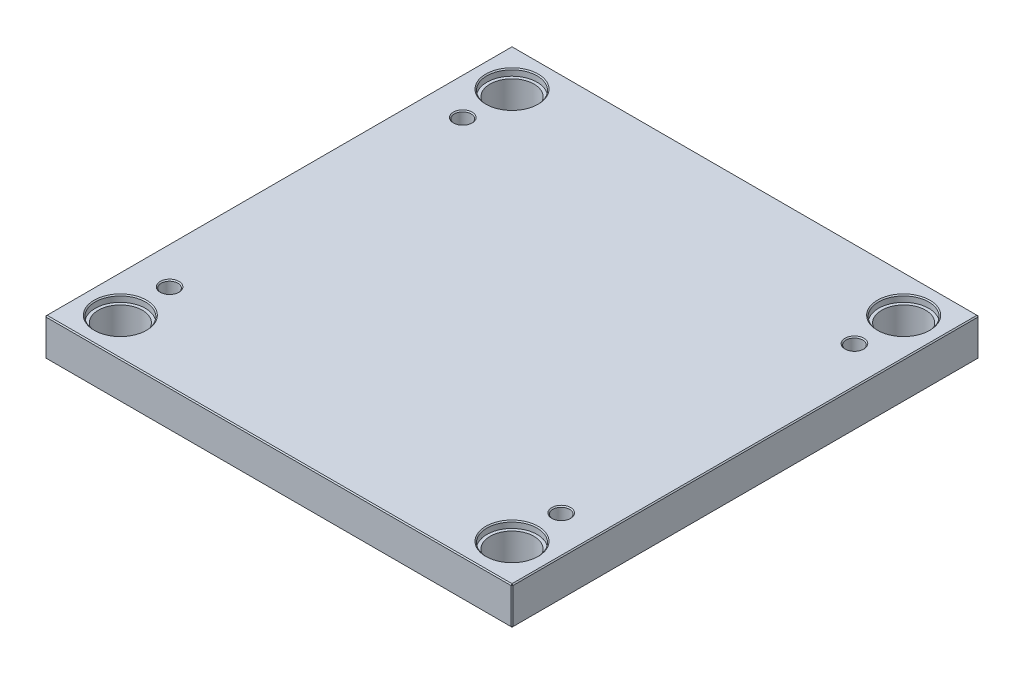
ISO-10303-21;
HEADER;
FILE_DESCRIPTION(('STEP AP214'),'2;1');
FILE_NAME('part.step','',(''),(''),'','','');
FILE_SCHEMA(('AUTOMOTIVE_DESIGN { 1 0 10303 214 1 1 1 1 }'));
ENDSEC;
DATA;
#1=APPLICATION_CONTEXT('core data for automotive mechanical design processes');
#2=APPLICATION_PROTOCOL_DEFINITION('international standard','automotive_design',2000,#1);
#3=PRODUCT_CONTEXT('',#1,'mechanical');
#4=PRODUCT('Part','Part','',(#3));
#5=PRODUCT_RELATED_PRODUCT_CATEGORY('part','',(#4));
#6=PRODUCT_DEFINITION_FORMATION('','',#4);
#7=PRODUCT_DEFINITION_CONTEXT('part definition',#1,'design');
#8=PRODUCT_DEFINITION('design','',#6,#7);
#9=PRODUCT_DEFINITION_SHAPE('','',#8);
#10=(LENGTH_UNIT() NAMED_UNIT(*) SI_UNIT(.MILLI.,.METRE.));
#11=(NAMED_UNIT(*) PLANE_ANGLE_UNIT() SI_UNIT($,.RADIAN.));
#12=(NAMED_UNIT(*) SI_UNIT($,.STERADIAN.) SOLID_ANGLE_UNIT());
#13=UNCERTAINTY_MEASURE_WITH_UNIT(LENGTH_MEASURE(1.E-05),#10,'distance_accuracy_value','');
#14=(GEOMETRIC_REPRESENTATION_CONTEXT(3) GLOBAL_UNCERTAINTY_ASSIGNED_CONTEXT((#13)) GLOBAL_UNIT_ASSIGNED_CONTEXT((#10,
#11,#12)) REPRESENTATION_CONTEXT('',''));
#15=CARTESIAN_POINT('',(0.,0.,0.));
#16=DIRECTION('',(0.,0.,1.));
#17=DIRECTION('',(1.,0.,0.));
#18=AXIS2_PLACEMENT_3D('',#15,#16,#17);
#19=CARTESIAN_POINT('',(-187.,0.,-187.));
#20=DIRECTION('',(0.,1.,0.));
#21=DIRECTION('',(0.,0.,1.));
#22=AXIS2_PLACEMENT_3D('',#19,#20,#21);
#23=CYLINDRICAL_SURFACE('',#22,21.);
#24=CARTESIAN_POINT('',(-187.,1.00000000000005,-187.));
#25=DIRECTION('',(0.,1.,0.));
#26=DIRECTION('',(0.,0.,1.));
#27=AXIS2_PLACEMENT_3D('',#24,#25,#26);
#28=CIRCLE('',#27,21.);
#29=CARTESIAN_POINT('',(-187.,1.00000000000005,-166.));
#30=VERTEX_POINT('',#29);
#31=EDGE_CURVE('E472',#30,#30,#28,.F.);
#32=ORIENTED_EDGE('',*,*,#31,.T.);
#33=EDGE_LOOP('',(#32));
#34=FACE_BOUND('',#33,.T.);
#35=CARTESIAN_POINT('',(-187.,29.7,-187.));
#36=DIRECTION('',(0.,1.,0.));
#37=DIRECTION('',(0.,0.,1.));
#38=AXIS2_PLACEMENT_3D('',#35,#36,#37);
#39=CIRCLE('',#38,21.);
#40=CARTESIAN_POINT('',(-187.,29.7,-166.));
#41=VERTEX_POINT('',#40);
#42=EDGE_CURVE('E221',#41,#41,#39,.F.);
#43=ORIENTED_EDGE('',*,*,#42,.F.);
#44=EDGE_LOOP('',(#43));
#45=FACE_BOUND('',#44,.T.);
#46=ADVANCED_FACE('F16',(#34,#45),#23,.F.);
#47=CARTESIAN_POINT('',(187.,0.,-187.));
#48=DIRECTION('',(0.,1.,0.));
#49=DIRECTION('',(0.,0.,1.));
#50=AXIS2_PLACEMENT_3D('',#47,#48,#49);
#51=CYLINDRICAL_SURFACE('',#50,21.);
#52=CARTESIAN_POINT('',(187.,1.00000000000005,-187.));
#53=DIRECTION('',(0.,1.,0.));
#54=DIRECTION('',(0.,0.,1.));
#55=AXIS2_PLACEMENT_3D('',#52,#53,#54);
#56=CIRCLE('',#55,21.);
#57=CARTESIAN_POINT('',(187.,1.00000000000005,-166.));
#58=VERTEX_POINT('',#57);
#59=EDGE_CURVE('E474',#58,#58,#56,.F.);
#60=ORIENTED_EDGE('',*,*,#59,.T.);
#61=EDGE_LOOP('',(#60));
#62=FACE_BOUND('',#61,.T.);
#63=CARTESIAN_POINT('',(187.,29.7,-187.));
#64=DIRECTION('',(0.,1.,0.));
#65=DIRECTION('',(0.,0.,1.));
#66=AXIS2_PLACEMENT_3D('',#63,#64,#65);
#67=CIRCLE('',#66,21.);
#68=CARTESIAN_POINT('',(187.,29.7,-166.));
#69=VERTEX_POINT('',#68);
#70=EDGE_CURVE('E218',#69,#69,#67,.F.);
#71=ORIENTED_EDGE('',*,*,#70,.F.);
#72=EDGE_LOOP('',(#71));
#73=FACE_BOUND('',#72,.T.);
#74=ADVANCED_FACE('F263',(#62,#73),#51,.F.);
#75=CARTESIAN_POINT('',(187.,0.,187.));
#76=DIRECTION('',(0.,1.,0.));
#77=DIRECTION('',(0.,0.,1.));
#78=AXIS2_PLACEMENT_3D('',#75,#76,#77);
#79=CYLINDRICAL_SURFACE('',#78,21.);
#80=CARTESIAN_POINT('',(187.,0.999999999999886,187.));
#81=DIRECTION('',(0.,1.,0.));
#82=DIRECTION('',(0.,0.,1.));
#83=AXIS2_PLACEMENT_3D('',#80,#81,#82);
#84=CIRCLE('',#83,21.);
#85=CARTESIAN_POINT('',(187.,0.999999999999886,208.));
#86=VERTEX_POINT('',#85);
#87=EDGE_CURVE('E477',#86,#86,#84,.F.);
#88=ORIENTED_EDGE('',*,*,#87,.T.);
#89=EDGE_LOOP('',(#88));
#90=FACE_BOUND('',#89,.T.);
#91=CARTESIAN_POINT('',(187.,29.7,187.));
#92=DIRECTION('',(0.,1.,0.));
#93=DIRECTION('',(0.,0.,1.));
#94=AXIS2_PLACEMENT_3D('',#91,#92,#93);
#95=CIRCLE('',#94,21.);
#96=CARTESIAN_POINT('',(187.,29.7,208.));
#97=VERTEX_POINT('',#96);
#98=EDGE_CURVE('E214',#97,#97,#95,.F.);
#99=ORIENTED_EDGE('',*,*,#98,.F.);
#100=EDGE_LOOP('',(#99));
#101=FACE_BOUND('',#100,.T.);
#102=ADVANCED_FACE('F270',(#90,#101),#79,.F.);
#103=CARTESIAN_POINT('',(-187.,0.,187.));
#104=DIRECTION('',(0.,1.,0.));
#105=DIRECTION('',(0.,0.,1.));
#106=AXIS2_PLACEMENT_3D('',#103,#104,#105);
#107=CYLINDRICAL_SURFACE('',#106,21.);
#108=CARTESIAN_POINT('',(-187.,0.999999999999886,187.));
#109=DIRECTION('',(0.,1.,0.));
#110=DIRECTION('',(0.,0.,1.));
#111=AXIS2_PLACEMENT_3D('',#108,#109,#110);
#112=CIRCLE('',#111,21.);
#113=CARTESIAN_POINT('',(-187.,0.999999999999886,208.));
#114=VERTEX_POINT('',#113);
#115=EDGE_CURVE('E480',#114,#114,#112,.F.);
#116=ORIENTED_EDGE('',*,*,#115,.T.);
#117=EDGE_LOOP('',(#116));
#118=FACE_BOUND('',#117,.T.);
#119=CARTESIAN_POINT('',(-187.,29.7,187.));
#120=DIRECTION('',(0.,1.,0.));
#121=DIRECTION('',(0.,0.,1.));
#122=AXIS2_PLACEMENT_3D('',#119,#120,#121);
#123=CIRCLE('',#122,21.);
#124=CARTESIAN_POINT('',(-187.,29.7,208.));
#125=VERTEX_POINT('',#124);
#126=EDGE_CURVE('E211',#125,#125,#123,.F.);
#127=ORIENTED_EDGE('',*,*,#126,.F.);
#128=EDGE_LOOP('',(#127));
#129=FACE_BOUND('',#128,.T.);
#130=ADVANCED_FACE('F277',(#118,#129),#107,.F.);
#131=CARTESIAN_POINT('',(-223.,36.,223.));
#132=DIRECTION('',(1.,0.,0.));
#133=DIRECTION('',(0.,0.,-1.));
#134=AXIS2_PLACEMENT_3D('',#131,#132,#133);
#135=PLANE('',#134);
#136=DIRECTION('',(0.,-1.,0.));
#137=VECTOR('',#136,1.);
#138=CARTESIAN_POINT('',(-223.,36.,-222.));
#139=LINE('',#138,#137);
#140=CARTESIAN_POINT('',(-223.,35.,-222.));
#141=VERTEX_POINT('',#140);
#142=CARTESIAN_POINT('',(-223.,1.,-222.));
#143=VERTEX_POINT('',#142);
#144=EDGE_CURVE('E487',#141,#143,#139,.T.);
#145=ORIENTED_EDGE('',*,*,#144,.T.);
#146=DIRECTION('',(0.,0.,1.));
#147=VECTOR('',#146,1.);
#148=CARTESIAN_POINT('',(-223.,1.,223.));
#149=LINE('',#148,#147);
#150=CARTESIAN_POINT('',(-223.,1.,222.));
#151=VERTEX_POINT('',#150);
#152=EDGE_CURVE('E490',#143,#151,#149,.T.);
#153=ORIENTED_EDGE('',*,*,#152,.T.);
#154=DIRECTION('',(0.,1.,0.));
#155=VECTOR('',#154,1.);
#156=CARTESIAN_POINT('',(-223.,36.,222.));
#157=LINE('',#156,#155);
#158=CARTESIAN_POINT('',(-223.,35.,222.));
#159=VERTEX_POINT('',#158);
#160=EDGE_CURVE('E485',#151,#159,#157,.T.);
#161=ORIENTED_EDGE('',*,*,#160,.T.);
#162=DIRECTION('',(0.,0.,-1.));
#163=VECTOR('',#162,1.);
#164=CARTESIAN_POINT('',(-223.,35.,-223.));
#165=LINE('',#164,#163);
#166=EDGE_CURVE('E483',#159,#141,#165,.T.);
#167=ORIENTED_EDGE('',*,*,#166,.T.);
#168=EDGE_LOOP('',(#145,#153,#161,#167));
#169=FACE_BOUND('',#168,.T.);
#170=ADVANCED_FACE('F298',(#169),#135,.F.);
#171=CARTESIAN_POINT('',(223.,36.,223.));
#172=DIRECTION('',(0.,0.,-1.));
#173=DIRECTION('',(-1.,0.,0.));
#174=AXIS2_PLACEMENT_3D('',#171,#172,#173);
#175=PLANE('',#174);
#176=DIRECTION('',(-1.,0.,0.));
#177=VECTOR('',#176,1.);
#178=CARTESIAN_POINT('',(-223.,35.,223.));
#179=LINE('',#178,#177);
#180=CARTESIAN_POINT('',(222.,35.,223.));
#181=VERTEX_POINT('',#180);
#182=CARTESIAN_POINT('',(-222.,35.,223.));
#183=VERTEX_POINT('',#182);
#184=EDGE_CURVE('E509',#181,#183,#179,.T.);
#185=ORIENTED_EDGE('',*,*,#184,.T.);
#186=DIRECTION('',(0.,-1.,0.));
#187=VECTOR('',#186,1.);
#188=CARTESIAN_POINT('',(-222.,36.,223.));
#189=LINE('',#188,#187);
#190=CARTESIAN_POINT('',(-222.,1.,223.));
#191=VERTEX_POINT('',#190);
#192=EDGE_CURVE('E515',#183,#191,#189,.T.);
#193=ORIENTED_EDGE('',*,*,#192,.T.);
#194=DIRECTION('',(1.,0.,0.));
#195=VECTOR('',#194,1.);
#196=CARTESIAN_POINT('',(223.,1.,223.));
#197=LINE('',#196,#195);
#198=CARTESIAN_POINT('',(222.,1.,223.));
#199=VERTEX_POINT('',#198);
#200=EDGE_CURVE('E513',#191,#199,#197,.T.);
#201=ORIENTED_EDGE('',*,*,#200,.T.);
#202=DIRECTION('',(0.,1.,0.));
#203=VECTOR('',#202,1.);
#204=CARTESIAN_POINT('',(222.,36.,223.));
#205=LINE('',#204,#203);
#206=EDGE_CURVE('E511',#199,#181,#205,.T.);
#207=ORIENTED_EDGE('',*,*,#206,.T.);
#208=EDGE_LOOP('',(#185,#193,#201,#207));
#209=FACE_BOUND('',#208,.T.);
#210=ADVANCED_FACE('F294',(#209),#175,.F.);
#211=CARTESIAN_POINT('',(223.,36.,223.));
#212=DIRECTION('',(-1.,0.,0.));
#213=DIRECTION('',(0.,0.,1.));
#214=AXIS2_PLACEMENT_3D('',#211,#212,#213);
#215=PLANE('',#214);
#216=DIRECTION('',(0.,0.,-1.));
#217=VECTOR('',#216,1.);
#218=CARTESIAN_POINT('',(223.,1.,223.));
#219=LINE('',#218,#217);
#220=CARTESIAN_POINT('',(223.,1.,222.));
#221=VERTEX_POINT('',#220);
#222=CARTESIAN_POINT('',(223.,1.,-222.));
#223=VERTEX_POINT('',#222);
#224=EDGE_CURVE('E504',#221,#223,#219,.T.);
#225=ORIENTED_EDGE('',*,*,#224,.T.);
#226=DIRECTION('',(0.,1.,0.));
#227=VECTOR('',#226,1.);
#228=CARTESIAN_POINT('',(223.,36.,-222.));
#229=LINE('',#228,#227);
#230=CARTESIAN_POINT('',(223.,35.,-222.));
#231=VERTEX_POINT('',#230);
#232=EDGE_CURVE('E506',#223,#231,#229,.T.);
#233=ORIENTED_EDGE('',*,*,#232,.T.);
#234=DIRECTION('',(0.,0.,1.));
#235=VECTOR('',#234,1.);
#236=CARTESIAN_POINT('',(223.,35.,223.));
#237=LINE('',#236,#235);
#238=CARTESIAN_POINT('',(223.,35.,222.));
#239=VERTEX_POINT('',#238);
#240=EDGE_CURVE('E500',#231,#239,#237,.T.);
#241=ORIENTED_EDGE('',*,*,#240,.T.);
#242=DIRECTION('',(0.,-1.,0.));
#243=VECTOR('',#242,1.);
#244=CARTESIAN_POINT('',(223.,36.,222.));
#245=LINE('',#244,#243);
#246=EDGE_CURVE('E502',#239,#221,#245,.T.);
#247=ORIENTED_EDGE('',*,*,#246,.T.);
#248=EDGE_LOOP('',(#225,#233,#241,#247));
#249=FACE_BOUND('',#248,.T.);
#250=ADVANCED_FACE('F290',(#249),#215,.F.);
#251=CARTESIAN_POINT('',(223.,36.,-223.));
#252=DIRECTION('',(0.,0.,1.));
#253=DIRECTION('',(1.,0.,0.));
#254=AXIS2_PLACEMENT_3D('',#251,#252,#253);
#255=PLANE('',#254);
#256=DIRECTION('',(0.,-1.,0.));
#257=VECTOR('',#256,1.);
#258=CARTESIAN_POINT('',(222.,36.,-223.));
#259=LINE('',#258,#257);
#260=CARTESIAN_POINT('',(222.,35.,-223.));
#261=VERTEX_POINT('',#260);
#262=CARTESIAN_POINT('',(222.,1.,-223.));
#263=VERTEX_POINT('',#262);
#264=EDGE_CURVE('E494',#261,#263,#259,.T.);
#265=ORIENTED_EDGE('',*,*,#264,.T.);
#266=DIRECTION('',(-1.,0.,0.));
#267=VECTOR('',#266,1.);
#268=CARTESIAN_POINT('',(223.,1.,-223.));
#269=LINE('',#268,#267);
#270=CARTESIAN_POINT('',(-222.,1.,-223.));
#271=VERTEX_POINT('',#270);
#272=EDGE_CURVE('E138',#263,#271,#269,.T.);
#273=ORIENTED_EDGE('',*,*,#272,.T.);
#274=DIRECTION('',(0.,1.,0.));
#275=VECTOR('',#274,1.);
#276=CARTESIAN_POINT('',(-222.,36.,-223.));
#277=LINE('',#276,#275);
#278=CARTESIAN_POINT('',(-222.,35.,-223.));
#279=VERTEX_POINT('',#278);
#280=EDGE_CURVE('E496',#271,#279,#277,.T.);
#281=ORIENTED_EDGE('',*,*,#280,.T.);
#282=DIRECTION('',(1.,0.,0.));
#283=VECTOR('',#282,1.);
#284=CARTESIAN_POINT('',(223.,35.,-223.));
#285=LINE('',#284,#283);
#286=EDGE_CURVE('E492',#279,#261,#285,.T.);
#287=ORIENTED_EDGE('',*,*,#286,.T.);
#288=EDGE_LOOP('',(#265,#273,#281,#287));
#289=FACE_BOUND('',#288,.T.);
#290=ADVANCED_FACE('F282',(#289),#255,.F.);
#291=CARTESIAN_POINT('',(0.,36.,0.));
#292=DIRECTION('',(0.,1.,0.));
#293=DIRECTION('',(0.,0.,1.));
#294=AXIS2_PLACEMENT_3D('',#291,#292,#293);
#295=PLANE('',#294);
#296=CARTESIAN_POINT('',(187.,36.,187.));
#297=DIRECTION('',(0.,1.,0.));
#298=DIRECTION('',(0.,0.,1.));
#299=AXIS2_PLACEMENT_3D('',#296,#297,#298);
#300=CIRCLE('',#299,25.);
#301=CARTESIAN_POINT('',(187.,36.,212.));
#302=VERTEX_POINT('',#301);
#303=EDGE_CURVE('E236',#302,#302,#300,.F.);
#304=ORIENTED_EDGE('',*,*,#303,.T.);
#305=EDGE_LOOP('',(#304));
#306=FACE_BOUND('',#305,.T.);
#307=CARTESIAN_POINT('',(-187.,36.,187.));
#308=DIRECTION('',(0.,1.,0.));
#309=DIRECTION('',(0.,0.,1.));
#310=AXIS2_PLACEMENT_3D('',#307,#308,#309);
#311=CIRCLE('',#310,25.);
#312=CARTESIAN_POINT('',(-187.,36.,212.));
#313=VERTEX_POINT('',#312);
#314=EDGE_CURVE('E233',#313,#313,#311,.F.);
#315=ORIENTED_EDGE('',*,*,#314,.T.);
#316=EDGE_LOOP('',(#315));
#317=FACE_BOUND('',#316,.T.);
#318=CARTESIAN_POINT('',(187.,36.,-187.));
#319=DIRECTION('',(0.,1.,0.));
#320=DIRECTION('',(0.,0.,1.));
#321=AXIS2_PLACEMENT_3D('',#318,#319,#320);
#322=CIRCLE('',#321,25.);
#323=CARTESIAN_POINT('',(187.,36.,-162.));
#324=VERTEX_POINT('',#323);
#325=EDGE_CURVE('E230',#324,#324,#322,.F.);
#326=ORIENTED_EDGE('',*,*,#325,.T.);
#327=EDGE_LOOP('',(#326));
#328=FACE_BOUND('',#327,.T.);
#329=CARTESIAN_POINT('',(-187.,36.,-187.));
#330=DIRECTION('',(0.,1.,0.));
#331=DIRECTION('',(0.,0.,1.));
#332=AXIS2_PLACEMENT_3D('',#329,#330,#331);
#333=CIRCLE('',#332,25.);
#334=CARTESIAN_POINT('',(-187.,36.,-162.));
#335=VERTEX_POINT('',#334);
#336=EDGE_CURVE('E227',#335,#335,#333,.F.);
#337=ORIENTED_EDGE('',*,*,#336,.T.);
#338=EDGE_LOOP('',(#337));
#339=FACE_BOUND('',#338,.T.);
#340=CARTESIAN_POINT('',(-187.,36.,140.));
#341=DIRECTION('',(0.,1.,0.));
#342=DIRECTION('',(0.,0.,1.));
#343=AXIS2_PLACEMENT_3D('',#340,#341,#342);
#344=CIRCLE('',#343,9.);
#345=CARTESIAN_POINT('',(-187.,36.,149.));
#346=VERTEX_POINT('',#345);
#347=EDGE_CURVE('E198',#346,#346,#344,.F.);
#348=ORIENTED_EDGE('',*,*,#347,.T.);
#349=EDGE_LOOP('',(#348));
#350=FACE_BOUND('',#349,.T.);
#351=CARTESIAN_POINT('',(187.,36.,140.));
#352=DIRECTION('',(0.,1.,0.));
#353=DIRECTION('',(0.,0.,1.));
#354=AXIS2_PLACEMENT_3D('',#351,#352,#353);
#355=CIRCLE('',#354,9.);
#356=CARTESIAN_POINT('',(187.,36.,149.));
#357=VERTEX_POINT('',#356);
#358=EDGE_CURVE('E195',#357,#357,#355,.F.);
#359=ORIENTED_EDGE('',*,*,#358,.T.);
#360=EDGE_LOOP('',(#359));
#361=FACE_BOUND('',#360,.T.);
#362=CARTESIAN_POINT('',(187.,36.,-140.));
#363=DIRECTION('',(0.,1.,0.));
#364=DIRECTION('',(0.,0.,1.));
#365=AXIS2_PLACEMENT_3D('',#362,#363,#364);
#366=CIRCLE('',#365,9.);
#367=CARTESIAN_POINT('',(187.,36.,-131.));
#368=VERTEX_POINT('',#367);
#369=EDGE_CURVE('E192',#368,#368,#366,.F.);
#370=ORIENTED_EDGE('',*,*,#369,.T.);
#371=EDGE_LOOP('',(#370));
#372=FACE_BOUND('',#371,.T.);
#373=CARTESIAN_POINT('',(-187.,36.,-140.));
#374=DIRECTION('',(0.,1.,0.));
#375=DIRECTION('',(0.,0.,1.));
#376=AXIS2_PLACEMENT_3D('',#373,#374,#375);
#377=CIRCLE('',#376,9.);
#378=CARTESIAN_POINT('',(-187.,36.,-131.));
#379=VERTEX_POINT('',#378);
#380=EDGE_CURVE('E188',#379,#379,#377,.F.);
#381=ORIENTED_EDGE('',*,*,#380,.T.);
#382=EDGE_LOOP('',(#381));
#383=FACE_BOUND('',#382,.T.);
#384=DIRECTION('',(0.,0.,-1.));
#385=VECTOR('',#384,1.);
#386=CARTESIAN_POINT('',(222.,36.,-223.));
#387=LINE('',#386,#385);
#388=CARTESIAN_POINT('',(222.,36.,222.));
#389=VERTEX_POINT('',#388);
#390=CARTESIAN_POINT('',(222.,36.,-222.));
#391=VERTEX_POINT('',#390);
#392=EDGE_CURVE('E31',#389,#391,#387,.T.);
#393=ORIENTED_EDGE('',*,*,#392,.T.);
#394=DIRECTION('',(-1.,0.,0.));
#395=VECTOR('',#394,1.);
#396=CARTESIAN_POINT('',(-223.,36.,-222.));
#397=LINE('',#396,#395);
#398=CARTESIAN_POINT('',(-222.,36.,-222.));
#399=VERTEX_POINT('',#398);
#400=EDGE_CURVE('E189',#391,#399,#397,.T.);
#401=ORIENTED_EDGE('',*,*,#400,.T.);
#402=DIRECTION('',(0.,0.,1.));
#403=VECTOR('',#402,1.);
#404=CARTESIAN_POINT('',(-222.,36.,223.));
#405=LINE('',#404,#403);
#406=CARTESIAN_POINT('',(-222.,36.,222.));
#407=VERTEX_POINT('',#406);
#408=EDGE_CURVE('E518',#399,#407,#405,.T.);
#409=ORIENTED_EDGE('',*,*,#408,.T.);
#410=DIRECTION('',(1.,0.,0.));
#411=VECTOR('',#410,1.);
#412=CARTESIAN_POINT('',(223.,36.,222.));
#413=LINE('',#412,#411);
#414=EDGE_CURVE('E36',#407,#389,#413,.T.);
#415=ORIENTED_EDGE('',*,*,#414,.T.);
#416=EDGE_LOOP('',(#393,#401,#409,#415));
#417=FACE_BOUND('',#416,.T.);
#418=ADVANCED_FACE('F279',(#306,#317,#328,#339,#350,#361,#372,#383,#417),#295,.T.);
#419=CARTESIAN_POINT('',(0.,0.,0.));
#420=DIRECTION('',(0.,1.,0.));
#421=DIRECTION('',(0.,0.,1.));
#422=AXIS2_PLACEMENT_3D('',#419,#420,#421);
#423=PLANE('',#422);
#424=CARTESIAN_POINT('',(-187.,0.,-187.));
#425=DIRECTION('',(0.,1.,0.));
#426=DIRECTION('',(0.,0.,1.));
#427=AXIS2_PLACEMENT_3D('',#424,#425,#426);
#428=CIRCLE('',#427,22.);
#429=CARTESIAN_POINT('',(-187.,0.,-165.));
#430=VERTEX_POINT('',#429);
#431=EDGE_CURVE('E469',#430,#430,#428,.T.);
#432=ORIENTED_EDGE('',*,*,#431,.T.);
#433=EDGE_LOOP('',(#432));
#434=FACE_BOUND('',#433,.T.);
#435=CARTESIAN_POINT('',(187.,0.,-187.));
#436=DIRECTION('',(0.,1.,0.));
#437=DIRECTION('',(0.,0.,1.));
#438=AXIS2_PLACEMENT_3D('',#435,#436,#437);
#439=CIRCLE('',#438,22.);
#440=CARTESIAN_POINT('',(187.,0.,-165.));
#441=VERTEX_POINT('',#440);
#442=EDGE_CURVE('E466',#441,#441,#439,.T.);
#443=ORIENTED_EDGE('',*,*,#442,.T.);
#444=EDGE_LOOP('',(#443));
#445=FACE_BOUND('',#444,.T.);
#446=CARTESIAN_POINT('',(187.,0.,187.));
#447=DIRECTION('',(0.,1.,0.));
#448=DIRECTION('',(0.,0.,1.));
#449=AXIS2_PLACEMENT_3D('',#446,#447,#448);
#450=CIRCLE('',#449,22.);
#451=CARTESIAN_POINT('',(187.,0.,209.));
#452=VERTEX_POINT('',#451);
#453=EDGE_CURVE('E463',#452,#452,#450,.T.);
#454=ORIENTED_EDGE('',*,*,#453,.T.);
#455=EDGE_LOOP('',(#454));
#456=FACE_BOUND('',#455,.T.);
#457=CARTESIAN_POINT('',(-187.,0.,187.));
#458=DIRECTION('',(0.,1.,0.));
#459=DIRECTION('',(0.,0.,1.));
#460=AXIS2_PLACEMENT_3D('',#457,#458,#459);
#461=CIRCLE('',#460,22.);
#462=CARTESIAN_POINT('',(-187.,0.,209.));
#463=VERTEX_POINT('',#462);
#464=EDGE_CURVE('E460',#463,#463,#461,.T.);
#465=ORIENTED_EDGE('',*,*,#464,.T.);
#466=EDGE_LOOP('',(#465));
#467=FACE_BOUND('',#466,.T.);
#468=DIRECTION('',(0.,0.,1.));
#469=VECTOR('',#468,1.);
#470=CARTESIAN_POINT('',(222.,0.,0.));
#471=LINE('',#470,#469);
#472=CARTESIAN_POINT('',(222.,0.,-222.));
#473=VERTEX_POINT('',#472);
#474=CARTESIAN_POINT('',(222.,0.,222.));
#475=VERTEX_POINT('',#474);
#476=EDGE_CURVE('E108',#473,#475,#471,.T.);
#477=ORIENTED_EDGE('',*,*,#476,.T.);
#478=DIRECTION('',(-1.,0.,0.));
#479=VECTOR('',#478,1.);
#480=CARTESIAN_POINT('',(0.,0.,222.));
#481=LINE('',#480,#479);
#482=CARTESIAN_POINT('',(-222.,0.,222.));
#483=VERTEX_POINT('',#482);
#484=EDGE_CURVE('E458',#475,#483,#481,.T.);
#485=ORIENTED_EDGE('',*,*,#484,.T.);
#486=DIRECTION('',(0.,0.,-1.));
#487=VECTOR('',#486,1.);
#488=CARTESIAN_POINT('',(-222.,0.,0.));
#489=LINE('',#488,#487);
#490=CARTESIAN_POINT('',(-222.,0.,-222.));
#491=VERTEX_POINT('',#490);
#492=EDGE_CURVE('E110',#483,#491,#489,.T.);
#493=ORIENTED_EDGE('',*,*,#492,.T.);
#494=DIRECTION('',(1.,0.,0.));
#495=VECTOR('',#494,1.);
#496=CARTESIAN_POINT('',(0.,0.,-222.));
#497=LINE('',#496,#495);
#498=EDGE_CURVE('E104',#491,#473,#497,.T.);
#499=ORIENTED_EDGE('',*,*,#498,.T.);
#500=EDGE_LOOP('',(#477,#485,#493,#499));
#501=FACE_BOUND('',#500,.T.);
#502=ADVANCED_FACE('F106',(#434,#445,#456,#467,#501),#423,.F.);
#503=CARTESIAN_POINT('',(-187.,0.,-187.));
#504=DIRECTION('',(0.,-1.,0.));
#505=DIRECTION('',(0.,0.,-1.));
#506=AXIS2_PLACEMENT_3D('',#503,#504,#505);
#507=CONICAL_SURFACE('',#506,22.,0.785398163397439);
#508=ORIENTED_EDGE('',*,*,#31,.F.);
#509=EDGE_LOOP('',(#508));
#510=FACE_BOUND('',#509,.T.);
#511=ORIENTED_EDGE('',*,*,#431,.F.);
#512=EDGE_LOOP('',(#511));
#513=FACE_BOUND('',#512,.T.);
#514=ADVANCED_FACE('F286',(#510,#513),#507,.F.);
#515=CARTESIAN_POINT('',(187.,0.,-187.));
#516=DIRECTION('',(0.,-1.,0.));
#517=DIRECTION('',(0.,0.,-1.));
#518=AXIS2_PLACEMENT_3D('',#515,#516,#517);
#519=CONICAL_SURFACE('',#518,22.,0.785398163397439);
#520=ORIENTED_EDGE('',*,*,#59,.F.);
#521=EDGE_LOOP('',(#520));
#522=FACE_BOUND('',#521,.T.);
#523=ORIENTED_EDGE('',*,*,#442,.F.);
#524=EDGE_LOOP('',(#523));
#525=FACE_BOUND('',#524,.T.);
#526=ADVANCED_FACE('F305',(#522,#525),#519,.F.);
#527=CARTESIAN_POINT('',(187.,0.,187.));
#528=DIRECTION('',(0.,-1.,0.));
#529=DIRECTION('',(0.,0.,-1.));
#530=AXIS2_PLACEMENT_3D('',#527,#528,#529);
#531=CONICAL_SURFACE('',#530,22.,0.78539816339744);
#532=ORIENTED_EDGE('',*,*,#87,.F.);
#533=EDGE_LOOP('',(#532));
#534=FACE_BOUND('',#533,.T.);
#535=ORIENTED_EDGE('',*,*,#453,.F.);
#536=EDGE_LOOP('',(#535));
#537=FACE_BOUND('',#536,.T.);
#538=ADVANCED_FACE('F309',(#534,#537),#531,.F.);
#539=CARTESIAN_POINT('',(-187.,0.,187.));
#540=DIRECTION('',(0.,-1.,0.));
#541=DIRECTION('',(0.,0.,-1.));
#542=AXIS2_PLACEMENT_3D('',#539,#540,#541);
#543=CONICAL_SURFACE('',#542,22.,0.78539816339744);
#544=ORIENTED_EDGE('',*,*,#115,.F.);
#545=EDGE_LOOP('',(#544));
#546=FACE_BOUND('',#545,.T.);
#547=ORIENTED_EDGE('',*,*,#464,.F.);
#548=EDGE_LOOP('',(#547));
#549=FACE_BOUND('',#548,.T.);
#550=ADVANCED_FACE('F313',(#546,#549),#543,.F.);
#551=CARTESIAN_POINT('',(223.,36.,222.));
#552=DIRECTION('',(-0.707106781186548,0.,-0.707106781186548));
#553=DIRECTION('',(0.,-1.,0.));
#554=AXIS2_PLACEMENT_3D('',#551,#552,#553);
#555=PLANE('',#554);
#556=DIRECTION('',(-0.707106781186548,0.,0.707106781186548));
#557=VECTOR('',#556,1.);
#558=CARTESIAN_POINT('',(222.,35.,223.));
#559=LINE('',#558,#557);
#560=EDGE_CURVE('E126',#181,#239,#559,.F.);
#561=ORIENTED_EDGE('',*,*,#560,.F.);
#562=ORIENTED_EDGE('',*,*,#206,.F.);
#563=DIRECTION('',(0.707106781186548,0.,-0.707106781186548));
#564=VECTOR('',#563,1.);
#565=CARTESIAN_POINT('',(222.,1.,223.));
#566=LINE('',#565,#564);
#567=EDGE_CURVE('E180',#221,#199,#566,.F.);
#568=ORIENTED_EDGE('',*,*,#567,.F.);
#569=ORIENTED_EDGE('',*,*,#246,.F.);
#570=EDGE_LOOP('',(#561,#562,#568,#569));
#571=FACE_BOUND('',#570,.T.);
#572=ADVANCED_FACE('F317',(#571),#555,.F.);
#573=CARTESIAN_POINT('',(222.,35.,223.));
#574=DIRECTION('',(0.577350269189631,0.577350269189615,0.577350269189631));
#575=DIRECTION('',(0.707106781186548,0.,-0.707106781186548));
#576=AXIS2_PLACEMENT_3D('',#573,#574,#575);
#577=PLANE('',#576);
#578=DIRECTION('',(0.,-0.707106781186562,0.707106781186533));
#579=VECTOR('',#578,1.);
#580=CARTESIAN_POINT('',(222.,35.,223.));
#581=LINE('',#580,#579);
#582=EDGE_CURVE('E175',#181,#389,#581,.F.);
#583=ORIENTED_EDGE('',*,*,#582,.F.);
#584=ORIENTED_EDGE('',*,*,#560,.T.);
#585=DIRECTION('',(-0.707106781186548,0.707106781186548,0.));
#586=VECTOR('',#585,1.);
#587=CARTESIAN_POINT('',(222.5,35.5,222.));
#588=LINE('',#587,#586);
#589=EDGE_CURVE('E177',#389,#239,#588,.F.);
#590=ORIENTED_EDGE('',*,*,#589,.F.);
#591=EDGE_LOOP('',(#583,#584,#590));
#592=FACE_BOUND('',#591,.T.);
#593=ADVANCED_FACE('F385',(#592),#577,.T.);
#594=CARTESIAN_POINT('',(222.,1.,223.));
#595=DIRECTION('',(0.577350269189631,-0.577350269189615,0.577350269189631));
#596=DIRECTION('',(0.707106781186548,0.,-0.707106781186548));
#597=AXIS2_PLACEMENT_3D('',#594,#595,#596);
#598=PLANE('',#597);
#599=DIRECTION('',(-0.707106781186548,-0.707106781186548,0.));
#600=VECTOR('',#599,1.);
#601=CARTESIAN_POINT('',(222.5,0.499999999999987,222.));
#602=LINE('',#601,#600);
#603=EDGE_CURVE('E124',#221,#475,#602,.T.);
#604=ORIENTED_EDGE('',*,*,#603,.F.);
#605=ORIENTED_EDGE('',*,*,#567,.T.);
#606=DIRECTION('',(0.,0.707106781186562,0.707106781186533));
#607=VECTOR('',#606,1.);
#608=CARTESIAN_POINT('',(222.,1.,223.));
#609=LINE('',#608,#607);
#610=EDGE_CURVE('E172',#475,#199,#609,.T.);
#611=ORIENTED_EDGE('',*,*,#610,.F.);
#612=EDGE_LOOP('',(#604,#605,#611));
#613=FACE_BOUND('',#612,.T.);
#614=ADVANCED_FACE('F381',(#613),#598,.T.);
#615=CARTESIAN_POINT('',(222.,36.,0.));
#616=DIRECTION('',(0.707106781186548,0.707106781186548,0.));
#617=DIRECTION('',(0.,0.,1.));
#618=AXIS2_PLACEMENT_3D('',#615,#616,#617);
#619=PLANE('',#618);
#620=ORIENTED_EDGE('',*,*,#589,.T.);
#621=ORIENTED_EDGE('',*,*,#240,.F.);
#622=DIRECTION('',(0.707106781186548,-0.707106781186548,0.));
#623=VECTOR('',#622,1.);
#624=CARTESIAN_POINT('',(223.,35.,-222.));
#625=LINE('',#624,#623);
#626=EDGE_CURVE('E166',#391,#231,#625,.T.);
#627=ORIENTED_EDGE('',*,*,#626,.F.);
#628=ORIENTED_EDGE('',*,*,#392,.F.);
#629=EDGE_LOOP('',(#620,#621,#627,#628));
#630=FACE_BOUND('',#629,.T.);
#631=ADVANCED_FACE('F377',(#630),#619,.T.);
#632=CARTESIAN_POINT('',(0.,36.,222.));
#633=DIRECTION('',(0.,0.707106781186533,0.707106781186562));
#634=DIRECTION('',(-1.,0.,0.));
#635=AXIS2_PLACEMENT_3D('',#632,#633,#634);
#636=PLANE('',#635);
#637=ORIENTED_EDGE('',*,*,#582,.T.);
#638=ORIENTED_EDGE('',*,*,#414,.F.);
#639=DIRECTION('',(0.,0.707106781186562,-0.707106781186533));
#640=VECTOR('',#639,1.);
#641=CARTESIAN_POINT('',(-222.,35.5,222.5));
#642=LINE('',#641,#640);
#643=EDGE_CURVE('E163',#183,#407,#642,.T.);
#644=ORIENTED_EDGE('',*,*,#643,.F.);
#645=ORIENTED_EDGE('',*,*,#184,.F.);
#646=EDGE_LOOP('',(#637,#638,#644,#645));
#647=FACE_BOUND('',#646,.T.);
#648=ADVANCED_FACE('F373',(#647),#636,.T.);
#649=CARTESIAN_POINT('',(-222.,36.,223.));
#650=DIRECTION('',(0.707106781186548,0.,-0.707106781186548));
#651=DIRECTION('',(0.,-1.,0.));
#652=AXIS2_PLACEMENT_3D('',#649,#650,#651);
#653=PLANE('',#652);
#654=DIRECTION('',(0.707106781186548,0.,0.707106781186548));
#655=VECTOR('',#654,1.);
#656=CARTESIAN_POINT('',(-222.,1.,223.));
#657=LINE('',#656,#655);
#658=EDGE_CURVE('E157',#191,#151,#657,.F.);
#659=ORIENTED_EDGE('',*,*,#658,.F.);
#660=ORIENTED_EDGE('',*,*,#192,.F.);
#661=DIRECTION('',(-0.707106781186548,0.,-0.707106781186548));
#662=VECTOR('',#661,1.);
#663=CARTESIAN_POINT('',(-223.,35.,222.));
#664=LINE('',#663,#662);
#665=EDGE_CURVE('E160',#159,#183,#664,.F.);
#666=ORIENTED_EDGE('',*,*,#665,.F.);
#667=ORIENTED_EDGE('',*,*,#160,.F.);
#668=EDGE_LOOP('',(#659,#660,#666,#667));
#669=FACE_BOUND('',#668,.T.);
#670=ADVANCED_FACE('F369',(#669),#653,.F.);
#671=CARTESIAN_POINT('',(223.,1.,223.));
#672=DIRECTION('',(0.,0.707106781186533,-0.707106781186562));
#673=DIRECTION('',(1.,0.,0.));
#674=AXIS2_PLACEMENT_3D('',#671,#672,#673);
#675=PLANE('',#674);
#676=ORIENTED_EDGE('',*,*,#610,.T.);
#677=ORIENTED_EDGE('',*,*,#200,.F.);
#678=DIRECTION('',(0.,-0.707106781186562,-0.707106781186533));
#679=VECTOR('',#678,1.);
#680=CARTESIAN_POINT('',(-222.,1.,223.));
#681=LINE('',#680,#679);
#682=EDGE_CURVE('E135',#483,#191,#681,.F.);
#683=ORIENTED_EDGE('',*,*,#682,.F.);
#684=ORIENTED_EDGE('',*,*,#484,.F.);
#685=EDGE_LOOP('',(#676,#677,#683,#684));
#686=FACE_BOUND('',#685,.T.);
#687=ADVANCED_FACE('F366',(#686),#675,.F.);
#688=CARTESIAN_POINT('',(223.,1.,223.));
#689=DIRECTION('',(-0.707106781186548,0.707106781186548,0.));
#690=DIRECTION('',(0.,0.,-1.));
#691=AXIS2_PLACEMENT_3D('',#688,#689,#690);
#692=PLANE('',#691);
#693=ORIENTED_EDGE('',*,*,#603,.T.);
#694=ORIENTED_EDGE('',*,*,#476,.F.);
#695=DIRECTION('',(0.707106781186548,0.707106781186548,0.));
#696=VECTOR('',#695,1.);
#697=CARTESIAN_POINT('',(222.5,0.499999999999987,-222.));
#698=LINE('',#697,#696);
#699=EDGE_CURVE('E121',#223,#473,#698,.F.);
#700=ORIENTED_EDGE('',*,*,#699,.F.);
#701=ORIENTED_EDGE('',*,*,#224,.F.);
#702=EDGE_LOOP('',(#693,#694,#700,#701));
#703=FACE_BOUND('',#702,.T.);
#704=ADVANCED_FACE('F119',(#703),#692,.F.);
#705=CARTESIAN_POINT('',(222.,36.,-223.));
#706=DIRECTION('',(-0.707106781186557,0.,0.707106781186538));
#707=DIRECTION('',(0.,-1.,0.));
#708=AXIS2_PLACEMENT_3D('',#705,#706,#707);
#709=PLANE('',#708);
#710=DIRECTION('',(0.707106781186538,0.,0.707106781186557));
#711=VECTOR('',#710,1.);
#712=CARTESIAN_POINT('',(223.,35.,-222.));
#713=LINE('',#712,#711);
#714=EDGE_CURVE('E168',#231,#261,#713,.F.);
#715=ORIENTED_EDGE('',*,*,#714,.F.);
#716=ORIENTED_EDGE('',*,*,#232,.F.);
#717=DIRECTION('',(-0.707106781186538,0.,-0.707106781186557));
#718=VECTOR('',#717,1.);
#719=CARTESIAN_POINT('',(222.,1.,-223.));
#720=LINE('',#719,#718);
#721=EDGE_CURVE('E134',#263,#223,#720,.F.);
#722=ORIENTED_EDGE('',*,*,#721,.F.);
#723=ORIENTED_EDGE('',*,*,#264,.F.);
#724=EDGE_LOOP('',(#715,#716,#722,#723));
#725=FACE_BOUND('',#724,.T.);
#726=ADVANCED_FACE('F359',(#725),#709,.F.);
#727=CARTESIAN_POINT('',(223.,35.,-222.));
#728=DIRECTION('',(0.577350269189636,0.57735026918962,-0.57735026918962));
#729=DIRECTION('',(-0.707106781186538,0.,-0.707106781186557));
#730=AXIS2_PLACEMENT_3D('',#727,#728,#729);
#731=PLANE('',#730);
#732=ORIENTED_EDGE('',*,*,#626,.T.);
#733=ORIENTED_EDGE('',*,*,#714,.T.);
#734=DIRECTION('',(0.,0.707106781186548,0.707106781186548));
#735=VECTOR('',#734,1.);
#736=CARTESIAN_POINT('',(222.,35.5,-222.5));
#737=LINE('',#736,#735);
#738=EDGE_CURVE('E152',#391,#261,#737,.F.);
#739=ORIENTED_EDGE('',*,*,#738,.F.);
#740=EDGE_LOOP('',(#732,#733,#739));
#741=FACE_BOUND('',#740,.T.);
#742=ADVANCED_FACE('F355',(#741),#731,.T.);
#743=CARTESIAN_POINT('',(-223.,35.,222.));
#744=DIRECTION('',(-0.577350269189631,0.577350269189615,0.577350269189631));
#745=DIRECTION('',(0.707106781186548,0.,0.707106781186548));
#746=AXIS2_PLACEMENT_3D('',#743,#744,#745);
#747=PLANE('',#746);
#748=ORIENTED_EDGE('',*,*,#665,.T.);
#749=ORIENTED_EDGE('',*,*,#643,.T.);
#750=DIRECTION('',(-0.707106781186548,-0.707106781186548,0.));
#751=VECTOR('',#750,1.);
#752=CARTESIAN_POINT('',(-223.,35.,222.));
#753=LINE('',#752,#751);
#754=EDGE_CURVE('E143',#159,#407,#753,.F.);
#755=ORIENTED_EDGE('',*,*,#754,.F.);
#756=EDGE_LOOP('',(#748,#749,#755));
#757=FACE_BOUND('',#756,.T.);
#758=ADVANCED_FACE('F351',(#757),#747,.T.);
#759=CARTESIAN_POINT('',(-222.,1.,223.));
#760=DIRECTION('',(-0.577350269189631,-0.577350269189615,0.577350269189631));
#761=DIRECTION('',(0.707106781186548,0.,0.707106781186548));
#762=AXIS2_PLACEMENT_3D('',#759,#760,#761);
#763=PLANE('',#762);
#764=ORIENTED_EDGE('',*,*,#682,.T.);
#765=ORIENTED_EDGE('',*,*,#658,.T.);
#766=DIRECTION('',(-0.707106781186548,0.707106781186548,0.));
#767=VECTOR('',#766,1.);
#768=CARTESIAN_POINT('',(-222.5,0.499999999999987,222.));
#769=LINE('',#768,#767);
#770=EDGE_CURVE('E139',#483,#151,#769,.T.);
#771=ORIENTED_EDGE('',*,*,#770,.F.);
#772=EDGE_LOOP('',(#764,#765,#771));
#773=FACE_BOUND('',#772,.T.);
#774=ADVANCED_FACE('F348',(#773),#763,.T.);
#775=CARTESIAN_POINT('',(222.,1.,-223.));
#776=DIRECTION('',(0.577350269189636,-0.57735026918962,-0.57735026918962));
#777=DIRECTION('',(-0.707106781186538,0.,-0.707106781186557));
#778=AXIS2_PLACEMENT_3D('',#775,#776,#777);
#779=PLANE('',#778);
#780=ORIENTED_EDGE('',*,*,#721,.T.);
#781=ORIENTED_EDGE('',*,*,#699,.T.);
#782=DIRECTION('',(0.,-0.707106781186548,0.707106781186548));
#783=VECTOR('',#782,1.);
#784=CARTESIAN_POINT('',(222.,1.,-223.));
#785=LINE('',#784,#783);
#786=EDGE_CURVE('E131',#263,#473,#785,.T.);
#787=ORIENTED_EDGE('',*,*,#786,.F.);
#788=EDGE_LOOP('',(#780,#781,#787));
#789=FACE_BOUND('',#788,.T.);
#790=ADVANCED_FACE('F130',(#789),#779,.T.);
#791=CARTESIAN_POINT('',(0.,36.,-222.));
#792=DIRECTION('',(0.,0.707106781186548,-0.707106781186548));
#793=DIRECTION('',(1.,0.,0.));
#794=AXIS2_PLACEMENT_3D('',#791,#792,#793);
#795=PLANE('',#794);
#796=ORIENTED_EDGE('',*,*,#738,.T.);
#797=ORIENTED_EDGE('',*,*,#286,.F.);
#798=DIRECTION('',(0.,-0.707106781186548,-0.707106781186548));
#799=VECTOR('',#798,1.);
#800=CARTESIAN_POINT('',(-222.,35.,-223.));
#801=LINE('',#800,#799);
#802=EDGE_CURVE('E140',#399,#279,#801,.T.);
#803=ORIENTED_EDGE('',*,*,#802,.F.);
#804=ORIENTED_EDGE('',*,*,#400,.F.);
#805=EDGE_LOOP('',(#796,#797,#803,#804));
#806=FACE_BOUND('',#805,.T.);
#807=ADVANCED_FACE('F341',(#806),#795,.T.);
#808=CARTESIAN_POINT('',(-222.,36.,0.));
#809=DIRECTION('',(-0.707106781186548,0.707106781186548,0.));
#810=DIRECTION('',(0.,0.,-1.));
#811=AXIS2_PLACEMENT_3D('',#808,#809,#810);
#812=PLANE('',#811);
#813=ORIENTED_EDGE('',*,*,#754,.T.);
#814=ORIENTED_EDGE('',*,*,#408,.F.);
#815=DIRECTION('',(0.707106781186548,0.707106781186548,0.));
#816=VECTOR('',#815,1.);
#817=CARTESIAN_POINT('',(-222.5,35.5,-222.));
#818=LINE('',#817,#816);
#819=EDGE_CURVE('E146',#141,#399,#818,.T.);
#820=ORIENTED_EDGE('',*,*,#819,.F.);
#821=ORIENTED_EDGE('',*,*,#166,.F.);
#822=EDGE_LOOP('',(#813,#814,#820,#821));
#823=FACE_BOUND('',#822,.T.);
#824=ADVANCED_FACE('F337',(#823),#812,.T.);
#825=CARTESIAN_POINT('',(-223.,1.,223.));
#826=DIRECTION('',(0.707106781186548,0.707106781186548,0.));
#827=DIRECTION('',(0.,0.,1.));
#828=AXIS2_PLACEMENT_3D('',#825,#826,#827);
#829=PLANE('',#828);
#830=ORIENTED_EDGE('',*,*,#770,.T.);
#831=ORIENTED_EDGE('',*,*,#152,.F.);
#832=DIRECTION('',(0.707106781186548,-0.707106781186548,0.));
#833=VECTOR('',#832,1.);
#834=CARTESIAN_POINT('',(-223.,1.,-222.));
#835=LINE('',#834,#833);
#836=EDGE_CURVE('E529',#491,#143,#835,.F.);
#837=ORIENTED_EDGE('',*,*,#836,.F.);
#838=ORIENTED_EDGE('',*,*,#492,.F.);
#839=EDGE_LOOP('',(#830,#831,#837,#838));
#840=FACE_BOUND('',#839,.T.);
#841=ADVANCED_FACE('F334',(#840),#829,.F.);
#842=CARTESIAN_POINT('',(223.,1.,-223.));
#843=DIRECTION('',(0.,0.707106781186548,0.707106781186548));
#844=DIRECTION('',(-1.,0.,0.));
#845=AXIS2_PLACEMENT_3D('',#842,#843,#844);
#846=PLANE('',#845);
#847=ORIENTED_EDGE('',*,*,#786,.T.);
#848=ORIENTED_EDGE('',*,*,#498,.F.);
#849=DIRECTION('',(0.,0.707106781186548,-0.707106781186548));
#850=VECTOR('',#849,1.);
#851=CARTESIAN_POINT('',(-222.,0.5,-222.5));
#852=LINE('',#851,#850);
#853=EDGE_CURVE('E526',#271,#491,#852,.F.);
#854=ORIENTED_EDGE('',*,*,#853,.F.);
#855=ORIENTED_EDGE('',*,*,#272,.F.);
#856=EDGE_LOOP('',(#847,#848,#854,#855));
#857=FACE_BOUND('',#856,.T.);
#858=ADVANCED_FACE('F137',(#857),#846,.F.);
#859=CARTESIAN_POINT('',(-222.,35.,-223.));
#860=DIRECTION('',(-0.577350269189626,0.577350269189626,-0.577350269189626));
#861=DIRECTION('',(-0.707106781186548,0.,0.707106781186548));
#862=AXIS2_PLACEMENT_3D('',#859,#860,#861);
#863=PLANE('',#862);
#864=ORIENTED_EDGE('',*,*,#819,.T.);
#865=ORIENTED_EDGE('',*,*,#802,.T.);
#866=DIRECTION('',(0.707106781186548,0.,-0.707106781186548));
#867=VECTOR('',#866,1.);
#868=CARTESIAN_POINT('',(-222.,35.,-223.));
#869=LINE('',#868,#867);
#870=EDGE_CURVE('E524',#141,#279,#869,.T.);
#871=ORIENTED_EDGE('',*,*,#870,.F.);
#872=EDGE_LOOP('',(#864,#865,#871));
#873=FACE_BOUND('',#872,.T.);
#874=ADVANCED_FACE('F327',(#873),#863,.T.);
#875=CARTESIAN_POINT('',(-223.,1.,-222.));
#876=DIRECTION('',(-0.577350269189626,-0.577350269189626,-0.577350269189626));
#877=DIRECTION('',(-0.707106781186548,0.,0.707106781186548));
#878=AXIS2_PLACEMENT_3D('',#875,#876,#877);
#879=PLANE('',#878);
#880=ORIENTED_EDGE('',*,*,#853,.T.);
#881=ORIENTED_EDGE('',*,*,#836,.T.);
#882=DIRECTION('',(-0.707106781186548,0.,0.707106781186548));
#883=VECTOR('',#882,1.);
#884=CARTESIAN_POINT('',(-223.,1.,-222.));
#885=LINE('',#884,#883);
#886=EDGE_CURVE('E455',#271,#143,#885,.T.);
#887=ORIENTED_EDGE('',*,*,#886,.F.);
#888=EDGE_LOOP('',(#880,#881,#887));
#889=FACE_BOUND('',#888,.T.);
#890=ADVANCED_FACE('F323',(#889),#879,.T.);
#891=CARTESIAN_POINT('',(-223.,36.,-222.));
#892=DIRECTION('',(0.707106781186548,0.,0.707106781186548));
#893=DIRECTION('',(0.,-1.,0.));
#894=AXIS2_PLACEMENT_3D('',#891,#892,#893);
#895=PLANE('',#894);
#896=ORIENTED_EDGE('',*,*,#870,.T.);
#897=ORIENTED_EDGE('',*,*,#280,.F.);
#898=ORIENTED_EDGE('',*,*,#886,.T.);
#899=ORIENTED_EDGE('',*,*,#144,.F.);
#900=EDGE_LOOP('',(#896,#897,#898,#899));
#901=FACE_BOUND('',#900,.T.);
#902=ADVANCED_FACE('F319',(#901),#895,.F.);
#903=CARTESIAN_POINT('',(-187.,11.,-140.));
#904=DIRECTION('',(0.,1.,0.));
#905=DIRECTION('',(0.,0.,1.));
#906=AXIS2_PLACEMENT_3D('',#903,#904,#905);
#907=CYLINDRICAL_SURFACE('',#906,8.);
#908=CARTESIAN_POINT('',(-187.,35.,-140.));
#909=DIRECTION('',(0.,1.,0.));
#910=DIRECTION('',(0.,0.,1.));
#911=AXIS2_PLACEMENT_3D('',#908,#909,#910);
#912=CIRCLE('',#911,8.);
#913=CARTESIAN_POINT('',(-187.,35.,-132.));
#914=VERTEX_POINT('',#913);
#915=EDGE_CURVE('E207',#914,#914,#912,.T.);
#916=ORIENTED_EDGE('',*,*,#915,.T.);
#917=EDGE_LOOP('',(#916));
#918=FACE_BOUND('',#917,.T.);
#919=CARTESIAN_POINT('',(-187.,11.,-140.));
#920=DIRECTION('',(0.,1.,0.));
#921=DIRECTION('',(0.,0.,1.));
#922=AXIS2_PLACEMENT_3D('',#919,#920,#921);
#923=CIRCLE('',#922,8.);
#924=CARTESIAN_POINT('',(-187.,11.,-132.));
#925=VERTEX_POINT('',#924);
#926=EDGE_CURVE('E448',#925,#925,#923,.T.);
#927=ORIENTED_EDGE('',*,*,#926,.F.);
#928=EDGE_LOOP('',(#927));
#929=FACE_BOUND('',#928,.T.);
#930=ADVANCED_FACE('F322',(#918,#929),#907,.F.);
#931=CARTESIAN_POINT('',(-187.,11.,-140.));
#932=DIRECTION('',(0.,1.,0.));
#933=DIRECTION('',(0.,0.,1.));
#934=AXIS2_PLACEMENT_3D('',#931,#932,#933);
#935=PLANE('',#934);
#936=ORIENTED_EDGE('',*,*,#926,.T.);
#937=EDGE_LOOP('',(#936));
#938=FACE_BOUND('',#937,.T.);
#939=ADVANCED_FACE('F596',(#938),#935,.T.);
#940=CARTESIAN_POINT('',(187.,11.,-140.));
#941=DIRECTION('',(0.,1.,0.));
#942=DIRECTION('',(0.,0.,1.));
#943=AXIS2_PLACEMENT_3D('',#940,#941,#942);
#944=CYLINDRICAL_SURFACE('',#943,8.);
#945=CARTESIAN_POINT('',(187.,35.,-140.));
#946=DIRECTION('',(0.,1.,0.));
#947=DIRECTION('',(0.,0.,1.));
#948=AXIS2_PLACEMENT_3D('',#945,#946,#947);
#949=CIRCLE('',#948,8.);
#950=CARTESIAN_POINT('',(187.,35.,-132.));
#951=VERTEX_POINT('',#950);
#952=EDGE_CURVE('E204',#951,#951,#949,.T.);
#953=ORIENTED_EDGE('',*,*,#952,.T.);
#954=EDGE_LOOP('',(#953));
#955=FACE_BOUND('',#954,.T.);
#956=CARTESIAN_POINT('',(187.,11.,-140.));
#957=DIRECTION('',(0.,1.,0.));
#958=DIRECTION('',(0.,0.,1.));
#959=AXIS2_PLACEMENT_3D('',#956,#957,#958);
#960=CIRCLE('',#959,8.);
#961=CARTESIAN_POINT('',(187.,11.,-132.));
#962=VERTEX_POINT('',#961);
#963=EDGE_CURVE('E445',#962,#962,#960,.T.);
#964=ORIENTED_EDGE('',*,*,#963,.F.);
#965=EDGE_LOOP('',(#964));
#966=FACE_BOUND('',#965,.T.);
#967=ADVANCED_FACE('F592',(#955,#966),#944,.F.);
#968=CARTESIAN_POINT('',(187.,11.,-140.));
#969=DIRECTION('',(0.,1.,0.));
#970=DIRECTION('',(0.,0.,1.));
#971=AXIS2_PLACEMENT_3D('',#968,#969,#970);
#972=PLANE('',#971);
#973=ORIENTED_EDGE('',*,*,#963,.T.);
#974=EDGE_LOOP('',(#973));
#975=FACE_BOUND('',#974,.T.);
#976=ADVANCED_FACE('F588',(#975),#972,.T.);
#977=CARTESIAN_POINT('',(187.,11.,140.));
#978=DIRECTION('',(0.,1.,0.));
#979=DIRECTION('',(0.,0.,1.));
#980=AXIS2_PLACEMENT_3D('',#977,#978,#979);
#981=CYLINDRICAL_SURFACE('',#980,8.);
#982=CARTESIAN_POINT('',(187.,35.,140.));
#983=DIRECTION('',(0.,1.,0.));
#984=DIRECTION('',(0.,0.,1.));
#985=AXIS2_PLACEMENT_3D('',#982,#983,#984);
#986=CIRCLE('',#985,8.);
#987=CARTESIAN_POINT('',(187.,35.,148.));
#988=VERTEX_POINT('',#987);
#989=EDGE_CURVE('E201',#988,#988,#986,.T.);
#990=ORIENTED_EDGE('',*,*,#989,.T.);
#991=EDGE_LOOP('',(#990));
#992=FACE_BOUND('',#991,.T.);
#993=CARTESIAN_POINT('',(187.,11.,140.));
#994=DIRECTION('',(0.,1.,0.));
#995=DIRECTION('',(0.,0.,1.));
#996=AXIS2_PLACEMENT_3D('',#993,#994,#995);
#997=CIRCLE('',#996,8.);
#998=CARTESIAN_POINT('',(187.,11.,148.));
#999=VERTEX_POINT('',#998);
#1000=EDGE_CURVE('E449',#999,#999,#997,.T.);
#1001=ORIENTED_EDGE('',*,*,#1000,.F.);
#1002=EDGE_LOOP('',(#1001));
#1003=FACE_BOUND('',#1002,.T.);
#1004=ADVANCED_FACE('F591',(#992,#1003),#981,.F.);
#1005=CARTESIAN_POINT('',(187.,11.,140.));
#1006=DIRECTION('',(0.,1.,0.));
#1007=DIRECTION('',(0.,0.,1.));
#1008=AXIS2_PLACEMENT_3D('',#1005,#1006,#1007);
#1009=PLANE('',#1008);
#1010=ORIENTED_EDGE('',*,*,#1000,.T.);
#1011=EDGE_LOOP('',(#1010));
#1012=FACE_BOUND('',#1011,.T.);
#1013=ADVANCED_FACE('F598',(#1012),#1009,.T.);
#1014=CARTESIAN_POINT('',(-187.,11.,140.));
#1015=DIRECTION('',(0.,1.,0.));
#1016=DIRECTION('',(0.,0.,1.));
#1017=AXIS2_PLACEMENT_3D('',#1014,#1015,#1016);
#1018=CYLINDRICAL_SURFACE('',#1017,8.);
#1019=CARTESIAN_POINT('',(-187.,35.,140.));
#1020=DIRECTION('',(0.,1.,0.));
#1021=DIRECTION('',(0.,0.,1.));
#1022=AXIS2_PLACEMENT_3D('',#1019,#1020,#1021);
#1023=CIRCLE('',#1022,8.);
#1024=CARTESIAN_POINT('',(-187.,35.,148.));
#1025=VERTEX_POINT('',#1024);
#1026=EDGE_CURVE('E185',#1025,#1025,#1023,.T.);
#1027=ORIENTED_EDGE('',*,*,#1026,.T.);
#1028=EDGE_LOOP('',(#1027));
#1029=FACE_BOUND('',#1028,.T.);
#1030=CARTESIAN_POINT('',(-187.,11.,140.));
#1031=DIRECTION('',(0.,1.,0.));
#1032=DIRECTION('',(0.,0.,1.));
#1033=AXIS2_PLACEMENT_3D('',#1030,#1031,#1032);
#1034=CIRCLE('',#1033,8.);
#1035=CARTESIAN_POINT('',(-187.,11.,148.));
#1036=VERTEX_POINT('',#1035);
#1037=EDGE_CURVE('E224',#1036,#1036,#1034,.T.);
#1038=ORIENTED_EDGE('',*,*,#1037,.F.);
#1039=EDGE_LOOP('',(#1038));
#1040=FACE_BOUND('',#1039,.T.);
#1041=ADVANCED_FACE('F601',(#1029,#1040),#1018,.F.);
#1042=CARTESIAN_POINT('',(-187.,11.,140.));
#1043=DIRECTION('',(0.,1.,0.));
#1044=DIRECTION('',(0.,0.,1.));
#1045=AXIS2_PLACEMENT_3D('',#1042,#1043,#1044);
#1046=PLANE('',#1045);
#1047=ORIENTED_EDGE('',*,*,#1037,.T.);
#1048=EDGE_LOOP('',(#1047));
#1049=FACE_BOUND('',#1048,.T.);
#1050=ADVANCED_FACE('F397',(#1049),#1046,.T.);
#1051=CARTESIAN_POINT('',(-187.,35.,140.));
#1052=DIRECTION('',(0.,1.,0.));
#1053=DIRECTION('',(0.,0.,1.));
#1054=AXIS2_PLACEMENT_3D('',#1051,#1052,#1053);
#1055=CONICAL_SURFACE('',#1054,8.,0.785398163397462);
#1056=ORIENTED_EDGE('',*,*,#347,.F.);
#1057=EDGE_LOOP('',(#1056));
#1058=FACE_BOUND('',#1057,.T.);
#1059=ORIENTED_EDGE('',*,*,#1026,.F.);
#1060=EDGE_LOOP('',(#1059));
#1061=FACE_BOUND('',#1060,.T.);
#1062=ADVANCED_FACE('F393',(#1058,#1061),#1055,.F.);
#1063=CARTESIAN_POINT('',(187.,35.,140.));
#1064=DIRECTION('',(0.,1.,0.));
#1065=DIRECTION('',(0.,0.,1.));
#1066=AXIS2_PLACEMENT_3D('',#1063,#1064,#1065);
#1067=CONICAL_SURFACE('',#1066,8.,0.785398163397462);
#1068=ORIENTED_EDGE('',*,*,#358,.F.);
#1069=EDGE_LOOP('',(#1068));
#1070=FACE_BOUND('',#1069,.T.);
#1071=ORIENTED_EDGE('',*,*,#989,.F.);
#1072=EDGE_LOOP('',(#1071));
#1073=FACE_BOUND('',#1072,.T.);
#1074=ADVANCED_FACE('F396',(#1070,#1073),#1067,.F.);
#1075=CARTESIAN_POINT('',(187.,35.,-140.));
#1076=DIRECTION('',(0.,1.,0.));
#1077=DIRECTION('',(0.,0.,1.));
#1078=AXIS2_PLACEMENT_3D('',#1075,#1076,#1077);
#1079=CONICAL_SURFACE('',#1078,8.,0.785398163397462);
#1080=ORIENTED_EDGE('',*,*,#369,.F.);
#1081=EDGE_LOOP('',(#1080));
#1082=FACE_BOUND('',#1081,.T.);
#1083=ORIENTED_EDGE('',*,*,#952,.F.);
#1084=EDGE_LOOP('',(#1083));
#1085=FACE_BOUND('',#1084,.T.);
#1086=ADVANCED_FACE('F401',(#1082,#1085),#1079,.F.);
#1087=CARTESIAN_POINT('',(-187.,35.,-140.));
#1088=DIRECTION('',(0.,1.,0.));
#1089=DIRECTION('',(0.,0.,1.));
#1090=AXIS2_PLACEMENT_3D('',#1087,#1088,#1089);
#1091=CONICAL_SURFACE('',#1090,8.,0.785398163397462);
#1092=ORIENTED_EDGE('',*,*,#380,.F.);
#1093=EDGE_LOOP('',(#1092));
#1094=FACE_BOUND('',#1093,.T.);
#1095=ORIENTED_EDGE('',*,*,#915,.F.);
#1096=EDGE_LOOP('',(#1095));
#1097=FACE_BOUND('',#1096,.T.);
#1098=ADVANCED_FACE('F405',(#1094,#1097),#1091,.F.);
#1099=CARTESIAN_POINT('',(-187.,29.7,187.));
#1100=DIRECTION('',(0.,1.,0.));
#1101=DIRECTION('',(0.,0.,1.));
#1102=AXIS2_PLACEMENT_3D('',#1099,#1100,#1101);
#1103=PLANE('',#1102);
#1104=CARTESIAN_POINT('',(-187.,29.7,187.));
#1105=DIRECTION('',(0.,1.,0.));
#1106=DIRECTION('',(0.,0.,1.));
#1107=AXIS2_PLACEMENT_3D('',#1104,#1105,#1106);
#1108=CIRCLE('',#1107,24.);
#1109=CARTESIAN_POINT('',(-187.,29.7,211.));
#1110=VERTEX_POINT('',#1109);
#1111=EDGE_CURVE('E436',#1110,#1110,#1108,.T.);
#1112=ORIENTED_EDGE('',*,*,#1111,.T.);
#1113=EDGE_LOOP('',(#1112));
#1114=FACE_BOUND('',#1113,.T.);
#1115=ORIENTED_EDGE('',*,*,#126,.T.);
#1116=EDGE_LOOP('',(#1115));
#1117=FACE_BOUND('',#1116,.T.);
#1118=ADVANCED_FACE('F409',(#1114,#1117),#1103,.T.);
#1119=CARTESIAN_POINT('',(-187.,29.7,187.));
#1120=DIRECTION('',(0.,1.,0.));
#1121=DIRECTION('',(0.,0.,1.));
#1122=AXIS2_PLACEMENT_3D('',#1119,#1120,#1121);
#1123=CYLINDRICAL_SURFACE('',#1122,24.);
#1124=CARTESIAN_POINT('',(-187.,35.,187.));
#1125=DIRECTION('',(0.,1.,0.));
#1126=DIRECTION('',(0.,0.,1.));
#1127=AXIS2_PLACEMENT_3D('',#1124,#1125,#1126);
#1128=CIRCLE('',#1127,24.);
#1129=CARTESIAN_POINT('',(-187.,35.,211.));
#1130=VERTEX_POINT('',#1129);
#1131=EDGE_CURVE('E239',#1130,#1130,#1128,.T.);
#1132=ORIENTED_EDGE('',*,*,#1131,.T.);
#1133=EDGE_LOOP('',(#1132));
#1134=FACE_BOUND('',#1133,.T.);
#1135=ORIENTED_EDGE('',*,*,#1111,.F.);
#1136=EDGE_LOOP('',(#1135));
#1137=FACE_BOUND('',#1136,.T.);
#1138=ADVANCED_FACE('F574',(#1134,#1137),#1123,.F.);
#1139=CARTESIAN_POINT('',(187.,29.7,187.));
#1140=DIRECTION('',(0.,1.,0.));
#1141=DIRECTION('',(0.,0.,1.));
#1142=AXIS2_PLACEMENT_3D('',#1139,#1140,#1141);
#1143=PLANE('',#1142);
#1144=CARTESIAN_POINT('',(187.,29.7,187.));
#1145=DIRECTION('',(0.,1.,0.));
#1146=DIRECTION('',(0.,0.,1.));
#1147=AXIS2_PLACEMENT_3D('',#1144,#1145,#1146);
#1148=CIRCLE('',#1147,24.);
#1149=CARTESIAN_POINT('',(187.,29.7,211.));
#1150=VERTEX_POINT('',#1149);
#1151=EDGE_CURVE('E433',#1150,#1150,#1148,.T.);
#1152=ORIENTED_EDGE('',*,*,#1151,.T.);
#1153=EDGE_LOOP('',(#1152));
#1154=FACE_BOUND('',#1153,.T.);
#1155=ORIENTED_EDGE('',*,*,#98,.T.);
#1156=EDGE_LOOP('',(#1155));
#1157=FACE_BOUND('',#1156,.T.);
#1158=ADVANCED_FACE('F429',(#1154,#1157),#1143,.T.);
#1159=CARTESIAN_POINT('',(187.,29.7,187.));
#1160=DIRECTION('',(0.,1.,0.));
#1161=DIRECTION('',(0.,0.,1.));
#1162=AXIS2_PLACEMENT_3D('',#1159,#1160,#1161);
#1163=CYLINDRICAL_SURFACE('',#1162,24.);
#1164=CARTESIAN_POINT('',(187.,35.,187.));
#1165=DIRECTION('',(0.,1.,0.));
#1166=DIRECTION('',(0.,0.,1.));
#1167=AXIS2_PLACEMENT_3D('',#1164,#1165,#1166);
#1168=CIRCLE('',#1167,24.);
#1169=CARTESIAN_POINT('',(187.,35.,211.));
#1170=VERTEX_POINT('',#1169);
#1171=EDGE_CURVE('E210',#1170,#1170,#1168,.T.);
#1172=ORIENTED_EDGE('',*,*,#1171,.T.);
#1173=EDGE_LOOP('',(#1172));
#1174=FACE_BOUND('',#1173,.T.);
#1175=ORIENTED_EDGE('',*,*,#1151,.F.);
#1176=EDGE_LOOP('',(#1175));
#1177=FACE_BOUND('',#1176,.T.);
#1178=ADVANCED_FACE('F425',(#1174,#1177),#1163,.F.);
#1179=CARTESIAN_POINT('',(187.,29.7,-187.));
#1180=DIRECTION('',(0.,1.,0.));
#1181=DIRECTION('',(0.,0.,1.));
#1182=AXIS2_PLACEMENT_3D('',#1179,#1180,#1181);
#1183=PLANE('',#1182);
#1184=CARTESIAN_POINT('',(187.,29.7,-187.));
#1185=DIRECTION('',(0.,1.,0.));
#1186=DIRECTION('',(0.,0.,1.));
#1187=AXIS2_PLACEMENT_3D('',#1184,#1185,#1186);
#1188=CIRCLE('',#1187,24.);
#1189=CARTESIAN_POINT('',(187.,29.7,-163.));
#1190=VERTEX_POINT('',#1189);
#1191=EDGE_CURVE('E435',#1190,#1190,#1188,.T.);
#1192=ORIENTED_EDGE('',*,*,#1191,.T.);
#1193=EDGE_LOOP('',(#1192));
#1194=FACE_BOUND('',#1193,.T.);
#1195=ORIENTED_EDGE('',*,*,#70,.T.);
#1196=EDGE_LOOP('',(#1195));
#1197=FACE_BOUND('',#1196,.T.);
#1198=ADVANCED_FACE('F428',(#1194,#1197),#1183,.T.);
#1199=CARTESIAN_POINT('',(187.,29.7,-187.));
#1200=DIRECTION('',(0.,1.,0.));
#1201=DIRECTION('',(0.,0.,1.));
#1202=AXIS2_PLACEMENT_3D('',#1199,#1200,#1201);
#1203=CYLINDRICAL_SURFACE('',#1202,24.);
#1204=CARTESIAN_POINT('',(187.,35.,-187.));
#1205=DIRECTION('',(0.,1.,0.));
#1206=DIRECTION('',(0.,0.,1.));
#1207=AXIS2_PLACEMENT_3D('',#1204,#1205,#1206);
#1208=CIRCLE('',#1207,24.);
#1209=CARTESIAN_POINT('',(187.,35.,-163.));
#1210=VERTEX_POINT('',#1209);
#1211=EDGE_CURVE('E24',#1210,#1210,#1208,.T.);
#1212=ORIENTED_EDGE('',*,*,#1211,.T.);
#1213=EDGE_LOOP('',(#1212));
#1214=FACE_BOUND('',#1213,.T.);
#1215=ORIENTED_EDGE('',*,*,#1191,.F.);
#1216=EDGE_LOOP('',(#1215));
#1217=FACE_BOUND('',#1216,.T.);
#1218=ADVANCED_FACE('F244',(#1214,#1217),#1203,.F.);
#1219=CARTESIAN_POINT('',(-187.,29.7,-187.));
#1220=DIRECTION('',(0.,1.,0.));
#1221=DIRECTION('',(0.,0.,1.));
#1222=AXIS2_PLACEMENT_3D('',#1219,#1220,#1221);
#1223=PLANE('',#1222);
#1224=CARTESIAN_POINT('',(-187.,29.7,-187.));
#1225=DIRECTION('',(0.,1.,0.));
#1226=DIRECTION('',(0.,0.,1.));
#1227=AXIS2_PLACEMENT_3D('',#1224,#1225,#1226);
#1228=CIRCLE('',#1227,24.);
#1229=CARTESIAN_POINT('',(-187.,29.7,-163.));
#1230=VERTEX_POINT('',#1229);
#1231=EDGE_CURVE('E215',#1230,#1230,#1228,.T.);
#1232=ORIENTED_EDGE('',*,*,#1231,.T.);
#1233=EDGE_LOOP('',(#1232));
#1234=FACE_BOUND('',#1233,.T.);
#1235=ORIENTED_EDGE('',*,*,#42,.T.);
#1236=EDGE_LOOP('',(#1235));
#1237=FACE_BOUND('',#1236,.T.);
#1238=ADVANCED_FACE('F418',(#1234,#1237),#1223,.T.);
#1239=CARTESIAN_POINT('',(-187.,29.7,-187.));
#1240=DIRECTION('',(0.,1.,0.));
#1241=DIRECTION('',(0.,0.,1.));
#1242=AXIS2_PLACEMENT_3D('',#1239,#1240,#1241);
#1243=CYLINDRICAL_SURFACE('',#1242,24.);
#1244=CARTESIAN_POINT('',(-187.,35.,-187.));
#1245=DIRECTION('',(0.,1.,0.));
#1246=DIRECTION('',(0.,0.,1.));
#1247=AXIS2_PLACEMENT_3D('',#1244,#1245,#1246);
#1248=CIRCLE('',#1247,24.);
#1249=CARTESIAN_POINT('',(-187.,35.,-163.));
#1250=VERTEX_POINT('',#1249);
#1251=EDGE_CURVE('E10',#1250,#1250,#1248,.T.);
#1252=ORIENTED_EDGE('',*,*,#1251,.T.);
#1253=EDGE_LOOP('',(#1252));
#1254=FACE_BOUND('',#1253,.T.);
#1255=ORIENTED_EDGE('',*,*,#1231,.F.);
#1256=EDGE_LOOP('',(#1255));
#1257=FACE_BOUND('',#1256,.T.);
#1258=ADVANCED_FACE('F412',(#1254,#1257),#1243,.F.);
#1259=CARTESIAN_POINT('',(187.,35.,187.));
#1260=DIRECTION('',(0.,1.,0.));
#1261=DIRECTION('',(0.,0.,1.));
#1262=AXIS2_PLACEMENT_3D('',#1259,#1260,#1261);
#1263=CONICAL_SURFACE('',#1262,24.,0.785398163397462);
#1264=ORIENTED_EDGE('',*,*,#303,.F.);
#1265=EDGE_LOOP('',(#1264));
#1266=FACE_BOUND('',#1265,.T.);
#1267=ORIENTED_EDGE('',*,*,#1171,.F.);
#1268=EDGE_LOOP('',(#1267));
#1269=FACE_BOUND('',#1268,.T.);
#1270=ADVANCED_FACE('F258',(#1266,#1269),#1263,.F.);
#1271=CARTESIAN_POINT('',(-187.,35.,187.));
#1272=DIRECTION('',(0.,1.,0.));
#1273=DIRECTION('',(0.,0.,1.));
#1274=AXIS2_PLACEMENT_3D('',#1271,#1272,#1273);
#1275=CONICAL_SURFACE('',#1274,24.,0.785398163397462);
#1276=ORIENTED_EDGE('',*,*,#314,.F.);
#1277=EDGE_LOOP('',(#1276));
#1278=FACE_BOUND('',#1277,.T.);
#1279=ORIENTED_EDGE('',*,*,#1131,.F.);
#1280=EDGE_LOOP('',(#1279));
#1281=FACE_BOUND('',#1280,.T.);
#1282=ADVANCED_FACE('F249',(#1278,#1281),#1275,.F.);
#1283=CARTESIAN_POINT('',(187.,35.,-187.));
#1284=DIRECTION('',(0.,1.,0.));
#1285=DIRECTION('',(0.,0.,1.));
#1286=AXIS2_PLACEMENT_3D('',#1283,#1284,#1285);
#1287=CONICAL_SURFACE('',#1286,24.,0.785398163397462);
#1288=ORIENTED_EDGE('',*,*,#325,.F.);
#1289=EDGE_LOOP('',(#1288));
#1290=FACE_BOUND('',#1289,.T.);
#1291=ORIENTED_EDGE('',*,*,#1211,.F.);
#1292=EDGE_LOOP('',(#1291));
#1293=FACE_BOUND('',#1292,.T.);
#1294=ADVANCED_FACE('F247',(#1290,#1293),#1287,.F.);
#1295=CARTESIAN_POINT('',(-187.,35.,-187.));
#1296=DIRECTION('',(0.,1.,0.));
#1297=DIRECTION('',(0.,0.,1.));
#1298=AXIS2_PLACEMENT_3D('',#1295,#1296,#1297);
#1299=CONICAL_SURFACE('',#1298,24.,0.785398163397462);
#1300=ORIENTED_EDGE('',*,*,#336,.F.);
#1301=EDGE_LOOP('',(#1300));
#1302=FACE_BOUND('',#1301,.T.);
#1303=ORIENTED_EDGE('',*,*,#1251,.F.);
#1304=EDGE_LOOP('',(#1303));
#1305=FACE_BOUND('',#1304,.T.);
#1306=ADVANCED_FACE('F18',(#1302,#1305),#1299,.F.);
#1307=CLOSED_SHELL('',(#46,#74,#102,#130,#170,#210,#250,#290,#418,#502,#514,#526,#538,#550,#572,
#593,#614,#631,#648,#670,#687,#704,#726,#742,#758,#774,#790,#807,#824,#841,#858,#874,#890,#902,
#930,#939,#967,#976,#1004,#1013,#1041,#1050,#1062,#1074,#1086,#1098,#1118,#1138,#1158,#1178,
#1198,#1218,#1238,#1258,#1270,#1282,#1294,#1306));
#1308=MANIFOLD_SOLID_BREP('B1',#1307);
#1309=ADVANCED_BREP_SHAPE_REPRESENTATION('',(#18,#1308),#14);
#1310=SHAPE_DEFINITION_REPRESENTATION(#9,#1309);
ENDSEC;
END-ISO-10303-21;
